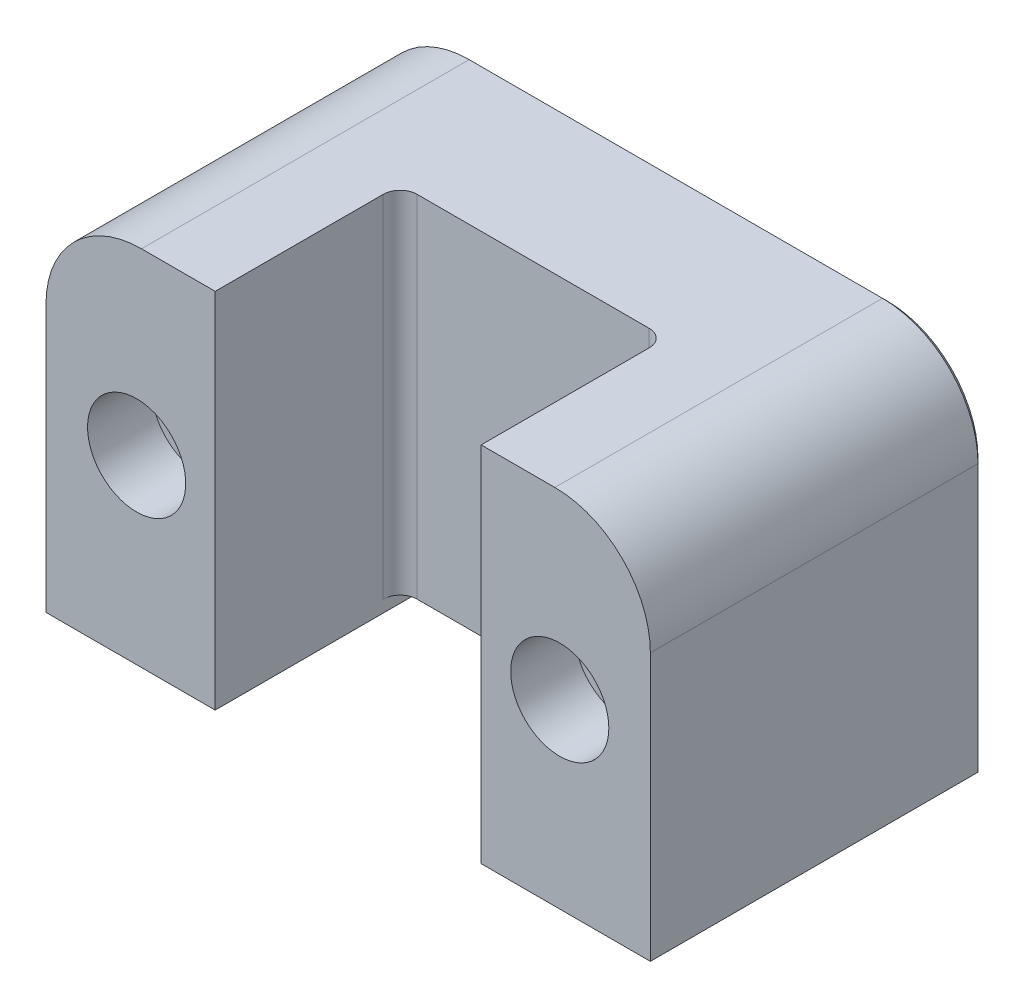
from build123d import *

# Parameters (mm, degrees)
EXTRUDE1_DEPTH     = 38.1
SKETCH3_W          = 27.94
SKETCH3_H          = 11.770125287
CUT_EXTRUDE2_DEPTH = 1.27
FILLET3_R          = 2.032
FILLET4_R          = 1.778
FILLET5_R          = 10.033
CHAMFER1_SIZE      = 0.508


with BuildPart() as part:
    # Sketch1 → Extrude1 (new body)
    with BuildSketch(Plane(origin=(0, 0, 0), x_dir=(1, 0, 0), z_dir=(0, 1, 0))):
        Polygon((-31.74365, 0), (-13.97, 0), (-13.97, 19.431), (13.97, 19.431), (13.97, 0), (31.74365, 0), (31.74365, 34.925), (-31.74365, 34.925), align=None)
    extrude(amount=EXTRUDE1_DEPTH)

    # Sketch3 → Cut-Extrude2 (cut)
    with BuildSketch(Plane.XZ):
        with Locations((0, -19.895937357)):
            Rectangle(SKETCH3_W, SKETCH3_H)
    extrude(amount=-CUT_EXTRUDE2_DEPTH, mode=Mode.SUBTRACT)

    # Fillet3
    fillet3_edges = [part.edges().sort_by_distance(p)[0] for p in [
        (-13.97, 0.635, -25.781),
        (13.97, 0.635, -25.781),
    ]]
    fillet(fillet3_edges, radius=FILLET3_R)

    # Fillet4
    fillet4_edges = [part.edges().sort_by_distance(p)[0] for p in [
        (13.97, 19.685, -19.431),
        (-13.97, 19.685, -19.431),
    ]]
    fillet(fillet4_edges, radius=FILLET4_R)

    # Sketch4 → Cut-Revolve9 (revolve, cut)
    with BuildSketch(Plane(origin=(0, 19.05, 0), x_dir=(-1, 0, 0), z_dir=(0, 1, 0)), mode=Mode.PRIVATE) as cut_revolve9_sk:
        Polygon((22.225, -34.925), (22.225, 0), (17.0688, 0), (17.0688, -6.7564), (18.6563, -6.7564), (18.6563, -34.925), align=None)
    cut_revolve9 = revolve(cut_revolve9_sk.sketch.rotate(Axis((-22.225, 19.05, -4.7498), (0, 0, 1)), 180), axis=Axis((-22.225, 19.05, -4.7498), (0, 0, 1)), mode=Mode.SUBTRACT)

    # Mirror1: Cut-Revolve9 across plane
    add(cut_revolve9.mirror(Plane(origin=(0, 0, 0), x_dir=(0, 0, 1), z_dir=(1, 0, 0))), mode=Mode.SUBTRACT)

    # Fillet5
    fillet5_edges = [part.edges().sort_by_distance(p)[0] for p in [
        (31.74365, 38.1, -17.4625),
        (-31.74365, 38.1, -17.4625),
    ]]
    fillet(fillet5_edges, radius=FILLET5_R)

    # Chamfer1
    chamfer1_edges = [part.edges().sort_by_distance(p)[0] for p in [
        (0, 38.1, -34.925),
        (-31.74365, 14.0335, -34.925),
        (31.74365, 14.0335, -34.925),
        (-28.805052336, 35.161402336, -34.925),
        (28.805052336, 35.161402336, -34.925),
    ]]
    chamfer(chamfer1_edges, length=CHAMFER1_SIZE)


solid = part.part
